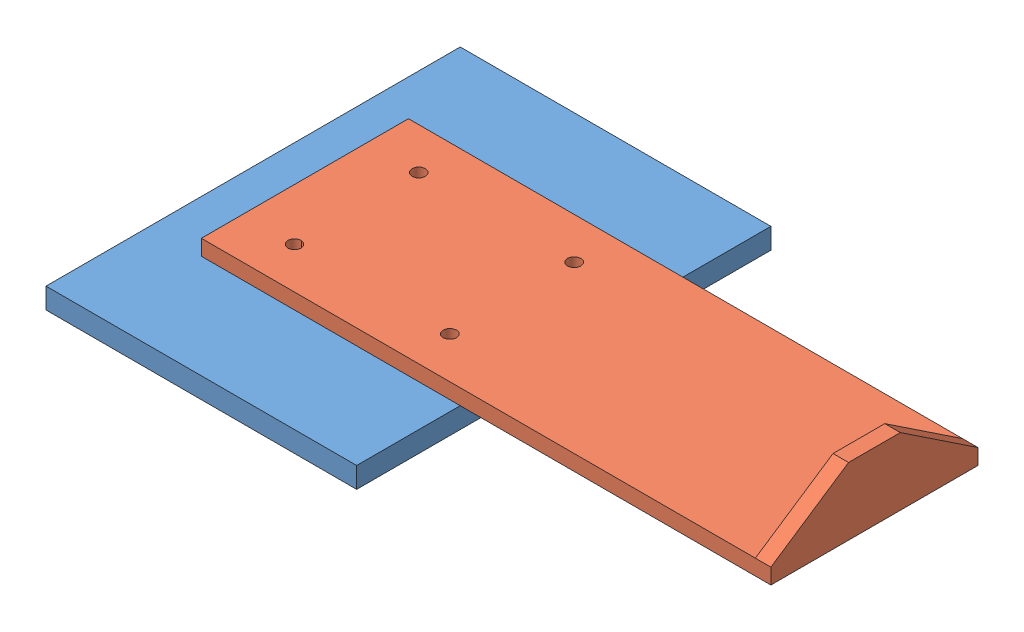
SolidWorks assembly Support Plate and Angle Bracket.SLDASM, configuration Default (file format 4100). Lengths in mm.
Overall size (600 85 400).
2 component instances, 2 part files, 3 mates.
Components (placement in the parent):
- Support Plate-1: Support Plate.SLDPRT [Default] at origin size (300 20 400)
- Angle Bracket-1: Angle Bracket.SLDPRT [Default] at (-100 15 0) size (550 65 200)
Mates (geometry in assembly coordinates):
- Coincident1: coincident: plane of Support Plate-1 through (-150 0 200) normal (0 1 0); plane of Angle Bracket-1 through (-100 0 -100) normal (0 -1 0)
- Concentric1: concentric: cylinder of Support Plate-1 through (100 -20 60) axis (0 1 0) radius 6.5; cylinder of Angle Bracket-1 through (100 0 60) axis (0 1 0) radius 6.5
- Concentric2: concentric aligned: cylinder of Support Plate-1 through (100 -20 -60) axis (0 1 0) radius 6.5; cylinder of Angle Bracket-1 through (100 0 -60) axis (0 1 0) radius 6.5
